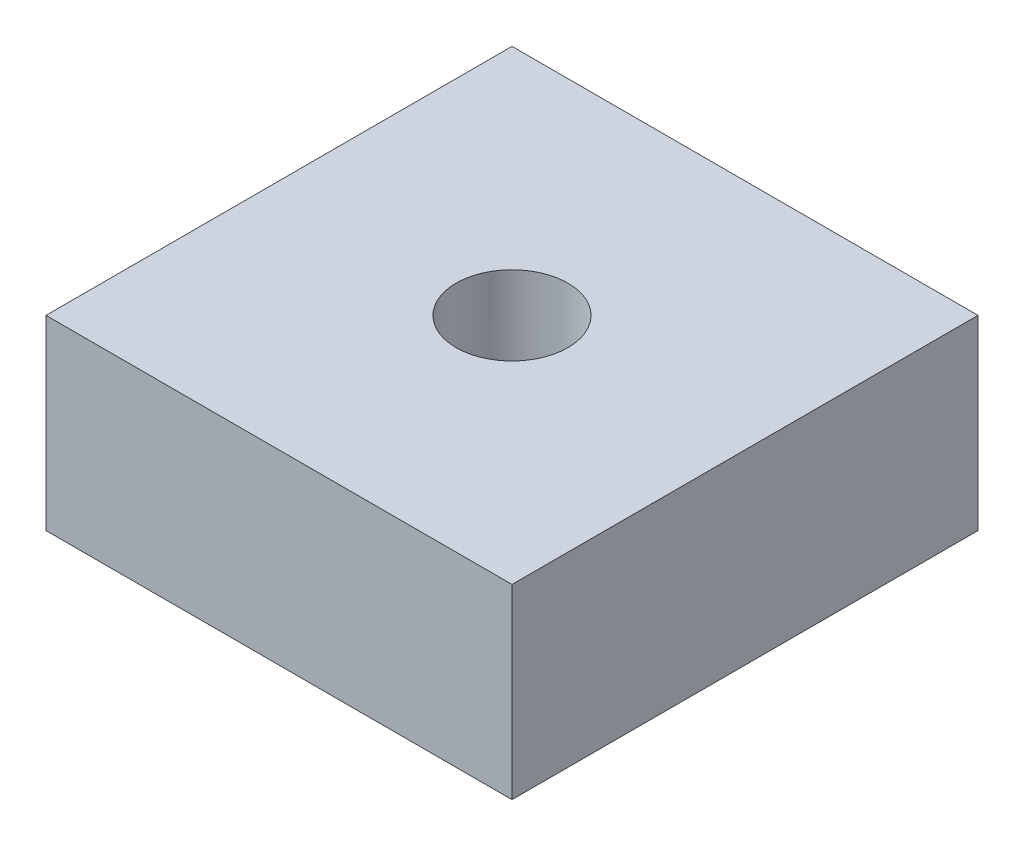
ISO-10303-21;
HEADER;
FILE_DESCRIPTION(('STEP AP214'),'2;1');
FILE_NAME('part.step','',(''),(''),'','','');
FILE_SCHEMA(('AUTOMOTIVE_DESIGN { 1 0 10303 214 1 1 1 1 }'));
ENDSEC;
DATA;
#1=APPLICATION_CONTEXT('core data for automotive mechanical design processes');
#2=APPLICATION_PROTOCOL_DEFINITION('international standard','automotive_design',2000,#1);
#3=PRODUCT_CONTEXT('',#1,'mechanical');
#4=PRODUCT('Part','Part','',(#3));
#5=PRODUCT_RELATED_PRODUCT_CATEGORY('part','',(#4));
#6=PRODUCT_DEFINITION_FORMATION('','',#4);
#7=PRODUCT_DEFINITION_CONTEXT('part definition',#1,'design');
#8=PRODUCT_DEFINITION('design','',#6,#7);
#9=PRODUCT_DEFINITION_SHAPE('','',#8);
#10=(LENGTH_UNIT() NAMED_UNIT(*) SI_UNIT(.MILLI.,.METRE.));
#11=(NAMED_UNIT(*) PLANE_ANGLE_UNIT() SI_UNIT($,.RADIAN.));
#12=(NAMED_UNIT(*) SI_UNIT($,.STERADIAN.) SOLID_ANGLE_UNIT());
#13=UNCERTAINTY_MEASURE_WITH_UNIT(LENGTH_MEASURE(1.E-05),#10,'distance_accuracy_value','');
#14=(GEOMETRIC_REPRESENTATION_CONTEXT(3) GLOBAL_UNCERTAINTY_ASSIGNED_CONTEXT((#13)) GLOBAL_UNIT_ASSIGNED_CONTEXT((#10,
#11,#12)) REPRESENTATION_CONTEXT('',''));
#15=CARTESIAN_POINT('',(0.,0.,0.));
#16=DIRECTION('',(0.,0.,1.));
#17=DIRECTION('',(1.,0.,0.));
#18=AXIS2_PLACEMENT_3D('',#15,#16,#17);
#19=CARTESIAN_POINT('',(12.5,10.,12.5));
#20=DIRECTION('',(-1.,0.,0.));
#21=DIRECTION('',(0.,0.,1.));
#22=AXIS2_PLACEMENT_3D('',#19,#20,#21);
#23=PLANE('',#22);
#24=DIRECTION('',(0.,0.,-1.));
#25=VECTOR('',#24,1.);
#26=CARTESIAN_POINT('',(12.5,0.,12.5));
#27=LINE('',#26,#25);
#28=CARTESIAN_POINT('',(12.5,0.,12.5));
#29=VERTEX_POINT('',#28);
#30=CARTESIAN_POINT('',(12.5,0.,-12.5));
#31=VERTEX_POINT('',#30);
#32=EDGE_CURVE('E104',#29,#31,#27,.T.);
#33=ORIENTED_EDGE('',*,*,#32,.T.);
#34=DIRECTION('',(0.,-1.,0.));
#35=VECTOR('',#34,1.);
#36=CARTESIAN_POINT('',(12.5,10.,-12.5));
#37=LINE('',#36,#35);
#38=CARTESIAN_POINT('',(12.5,10.,-12.5));
#39=VERTEX_POINT('',#38);
#40=EDGE_CURVE('E11',#39,#31,#37,.T.);
#41=ORIENTED_EDGE('',*,*,#40,.F.);
#42=DIRECTION('',(0.,0.,-1.));
#43=VECTOR('',#42,1.);
#44=CARTESIAN_POINT('',(12.5,10.,12.5));
#45=LINE('',#44,#43);
#46=CARTESIAN_POINT('',(12.5,10.,12.5));
#47=VERTEX_POINT('',#46);
#48=EDGE_CURVE('E92',#47,#39,#45,.T.);
#49=ORIENTED_EDGE('',*,*,#48,.F.);
#50=DIRECTION('',(0.,-1.,0.));
#51=VECTOR('',#50,1.);
#52=CARTESIAN_POINT('',(12.5,10.,12.5));
#53=LINE('',#52,#51);
#54=EDGE_CURVE('E100',#47,#29,#53,.T.);
#55=ORIENTED_EDGE('',*,*,#54,.T.);
#56=EDGE_LOOP('',(#33,#41,#49,#55));
#57=FACE_BOUND('',#56,.T.);
#58=ADVANCED_FACE('F41',(#57),#23,.F.);
#59=CARTESIAN_POINT('',(-12.5,10.,-12.5));
#60=DIRECTION('',(0.,0.,1.));
#61=DIRECTION('',(1.,0.,0.));
#62=AXIS2_PLACEMENT_3D('',#59,#60,#61);
#63=PLANE('',#62);
#64=DIRECTION('',(-1.,0.,0.));
#65=VECTOR('',#64,1.);
#66=CARTESIAN_POINT('',(-12.5,0.,-12.5));
#67=LINE('',#66,#65);
#68=CARTESIAN_POINT('',(-12.5,0.,-12.5));
#69=VERTEX_POINT('',#68);
#70=EDGE_CURVE('E96',#31,#69,#67,.T.);
#71=ORIENTED_EDGE('',*,*,#70,.T.);
#72=DIRECTION('',(0.,-1.,0.));
#73=VECTOR('',#72,1.);
#74=CARTESIAN_POINT('',(-12.5,10.,-12.5));
#75=LINE('',#74,#73);
#76=CARTESIAN_POINT('',(-12.5,10.,-12.5));
#77=VERTEX_POINT('',#76);
#78=EDGE_CURVE('E49',#77,#69,#75,.T.);
#79=ORIENTED_EDGE('',*,*,#78,.F.);
#80=DIRECTION('',(-1.,0.,0.));
#81=VECTOR('',#80,1.);
#82=CARTESIAN_POINT('',(-12.5,10.,-12.5));
#83=LINE('',#82,#81);
#84=EDGE_CURVE('E87',#39,#77,#83,.T.);
#85=ORIENTED_EDGE('',*,*,#84,.F.);
#86=ORIENTED_EDGE('',*,*,#40,.T.);
#87=EDGE_LOOP('',(#71,#79,#85,#86));
#88=FACE_BOUND('',#87,.T.);
#89=ADVANCED_FACE('F95',(#88),#63,.F.);
#90=CARTESIAN_POINT('',(-12.5,10.,12.5));
#91=DIRECTION('',(1.,0.,0.));
#92=DIRECTION('',(0.,0.,-1.));
#93=AXIS2_PLACEMENT_3D('',#90,#91,#92);
#94=PLANE('',#93);
#95=DIRECTION('',(0.,0.,1.));
#96=VECTOR('',#95,1.);
#97=CARTESIAN_POINT('',(-12.5,0.,12.5));
#98=LINE('',#97,#96);
#99=CARTESIAN_POINT('',(-12.5,0.,12.5));
#100=VERTEX_POINT('',#99);
#101=EDGE_CURVE('E74',#69,#100,#98,.T.);
#102=ORIENTED_EDGE('',*,*,#101,.T.);
#103=DIRECTION('',(0.,-1.,0.));
#104=VECTOR('',#103,1.);
#105=CARTESIAN_POINT('',(-12.5,10.,12.5));
#106=LINE('',#105,#104);
#107=CARTESIAN_POINT('',(-12.5,10.,12.5));
#108=VERTEX_POINT('',#107);
#109=EDGE_CURVE('E97',#108,#100,#106,.T.);
#110=ORIENTED_EDGE('',*,*,#109,.F.);
#111=DIRECTION('',(0.,0.,1.));
#112=VECTOR('',#111,1.);
#113=CARTESIAN_POINT('',(-12.5,10.,12.5));
#114=LINE('',#113,#112);
#115=EDGE_CURVE('E90',#77,#108,#114,.T.);
#116=ORIENTED_EDGE('',*,*,#115,.F.);
#117=ORIENTED_EDGE('',*,*,#78,.T.);
#118=EDGE_LOOP('',(#102,#110,#116,#117));
#119=FACE_BOUND('',#118,.T.);
#120=ADVANCED_FACE('F98',(#119),#94,.F.);
#121=CARTESIAN_POINT('',(-12.5,10.,12.5));
#122=DIRECTION('',(0.,0.,-1.));
#123=DIRECTION('',(-1.,0.,0.));
#124=AXIS2_PLACEMENT_3D('',#121,#122,#123);
#125=PLANE('',#124);
#126=DIRECTION('',(1.,0.,0.));
#127=VECTOR('',#126,1.);
#128=CARTESIAN_POINT('',(-12.5,0.,12.5));
#129=LINE('',#128,#127);
#130=EDGE_CURVE('E80',#100,#29,#129,.T.);
#131=ORIENTED_EDGE('',*,*,#130,.T.);
#132=ORIENTED_EDGE('',*,*,#54,.F.);
#133=DIRECTION('',(1.,0.,0.));
#134=VECTOR('',#133,1.);
#135=CARTESIAN_POINT('',(-12.5,10.,12.5));
#136=LINE('',#135,#134);
#137=EDGE_CURVE('E57',#108,#47,#136,.T.);
#138=ORIENTED_EDGE('',*,*,#137,.F.);
#139=ORIENTED_EDGE('',*,*,#109,.T.);
#140=EDGE_LOOP('',(#131,#132,#138,#139));
#141=FACE_BOUND('',#140,.T.);
#142=ADVANCED_FACE('F112',(#141),#125,.F.);
#143=CARTESIAN_POINT('',(0.,10.,0.));
#144=DIRECTION('',(0.,-1.,0.));
#145=DIRECTION('',(0.,0.,-1.));
#146=AXIS2_PLACEMENT_3D('',#143,#144,#145);
#147=PLANE('',#146);
#148=CARTESIAN_POINT('',(0.,10.,0.));
#149=DIRECTION('',(0.,1.,0.));
#150=DIRECTION('',(0.,0.,1.));
#151=AXIS2_PLACEMENT_3D('',#148,#149,#150);
#152=CIRCLE('',#151,3.);
#153=CARTESIAN_POINT('',(0.,10.,3.));
#154=VERTEX_POINT('',#153);
#155=EDGE_CURVE('E107',#154,#154,#152,.T.);
#156=ORIENTED_EDGE('',*,*,#155,.F.);
#157=EDGE_LOOP('',(#156));
#158=FACE_BOUND('',#157,.T.);
#159=ORIENTED_EDGE('',*,*,#48,.T.);
#160=ORIENTED_EDGE('',*,*,#84,.T.);
#161=ORIENTED_EDGE('',*,*,#115,.T.);
#162=ORIENTED_EDGE('',*,*,#137,.T.);
#163=EDGE_LOOP('',(#159,#160,#161,#162));
#164=FACE_BOUND('',#163,.T.);
#165=ADVANCED_FACE('F88',(#158,#164),#147,.F.);
#166=CARTESIAN_POINT('',(0.,0.,0.));
#167=DIRECTION('',(0.,-1.,0.));
#168=DIRECTION('',(0.,0.,-1.));
#169=AXIS2_PLACEMENT_3D('',#166,#167,#168);
#170=PLANE('',#169);
#171=CARTESIAN_POINT('',(0.,0.,0.));
#172=DIRECTION('',(0.,-1.,0.));
#173=DIRECTION('',(0.,0.,-1.));
#174=AXIS2_PLACEMENT_3D('',#171,#172,#173);
#175=CIRCLE('',#174,3.);
#176=CARTESIAN_POINT('',(0.,0.,-3.));
#177=VERTEX_POINT('',#176);
#178=EDGE_CURVE('E118',#177,#177,#175,.F.);
#179=ORIENTED_EDGE('',*,*,#178,.T.);
#180=EDGE_LOOP('',(#179));
#181=FACE_BOUND('',#180,.T.);
#182=ORIENTED_EDGE('',*,*,#32,.F.);
#183=ORIENTED_EDGE('',*,*,#130,.F.);
#184=ORIENTED_EDGE('',*,*,#101,.F.);
#185=ORIENTED_EDGE('',*,*,#70,.F.);
#186=EDGE_LOOP('',(#182,#183,#184,#185));
#187=FACE_BOUND('',#186,.T.);
#188=ADVANCED_FACE('F115',(#181,#187),#170,.T.);
#189=CARTESIAN_POINT('',(0.,-0.000999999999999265,0.));
#190=DIRECTION('',(0.,1.,0.));
#191=DIRECTION('',(0.,0.,1.));
#192=AXIS2_PLACEMENT_3D('',#189,#190,#191);
#193=CYLINDRICAL_SURFACE('',#192,3.);
#194=ORIENTED_EDGE('',*,*,#178,.F.);
#195=EDGE_LOOP('',(#194));
#196=FACE_BOUND('',#195,.T.);
#197=ORIENTED_EDGE('',*,*,#155,.T.);
#198=EDGE_LOOP('',(#197));
#199=FACE_BOUND('',#198,.T.);
#200=ADVANCED_FACE('F124',(#196,#199),#193,.F.);
#201=CLOSED_SHELL('',(#58,#89,#120,#142,#165,#188,#200));
#202=MANIFOLD_SOLID_BREP('B2',#201);
#203=ADVANCED_BREP_SHAPE_REPRESENTATION('',(#18,#202),#14);
#204=SHAPE_DEFINITION_REPRESENTATION(#9,#203);
ENDSEC;
END-ISO-10303-21;
